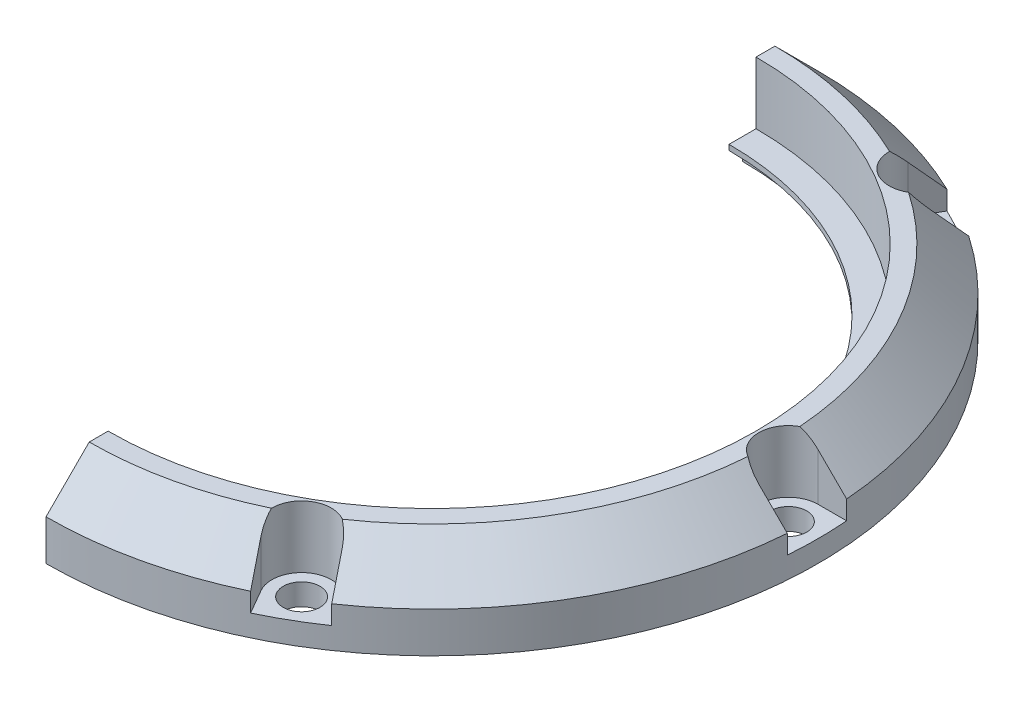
ISO-10303-21;
HEADER;
FILE_DESCRIPTION(('STEP AP214'),'2;1');
FILE_NAME('part.step','',(''),(''),'','','');
FILE_SCHEMA(('AUTOMOTIVE_DESIGN { 1 0 10303 214 1 1 1 1 }'));
ENDSEC;
DATA;
#1=APPLICATION_CONTEXT('core data for automotive mechanical design processes');
#2=APPLICATION_PROTOCOL_DEFINITION('international standard','automotive_design',2000,#1);
#3=PRODUCT_CONTEXT('',#1,'mechanical');
#4=PRODUCT('Part','Part','',(#3));
#5=PRODUCT_RELATED_PRODUCT_CATEGORY('part','',(#4));
#6=PRODUCT_DEFINITION_FORMATION('','',#4);
#7=PRODUCT_DEFINITION_CONTEXT('part definition',#1,'design');
#8=PRODUCT_DEFINITION('design','',#6,#7);
#9=PRODUCT_DEFINITION_SHAPE('','',#8);
#10=(LENGTH_UNIT() NAMED_UNIT(*) SI_UNIT(.MILLI.,.METRE.));
#11=(NAMED_UNIT(*) PLANE_ANGLE_UNIT() SI_UNIT($,.RADIAN.));
#12=(NAMED_UNIT(*) SI_UNIT($,.STERADIAN.) SOLID_ANGLE_UNIT());
#13=UNCERTAINTY_MEASURE_WITH_UNIT(LENGTH_MEASURE(1.E-05),#10,'distance_accuracy_value','');
#14=(GEOMETRIC_REPRESENTATION_CONTEXT(3) GLOBAL_UNCERTAINTY_ASSIGNED_CONTEXT((#13)) GLOBAL_UNIT_ASSIGNED_CONTEXT((#10,
#11,#12)) REPRESENTATION_CONTEXT('',''));
#15=CARTESIAN_POINT('',(0.,0.,0.));
#16=DIRECTION('',(0.,0.,1.));
#17=DIRECTION('',(1.,0.,0.));
#18=AXIS2_PLACEMENT_3D('',#15,#16,#17);
#19=CARTESIAN_POINT('',(0.,-10.51,-144.));
#20=DIRECTION('',(-1.,0.,0.));
#21=DIRECTION('',(0.,0.,1.));
#22=AXIS2_PLACEMENT_3D('',#19,#20,#21);
#23=PLANE('',#22);
#24=DIRECTION('',(0.,0.707106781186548,-0.707106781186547));
#25=VECTOR('',#24,1.);
#26=CARTESIAN_POINT('',(0.,68.5,-72.5));
#27=LINE('',#26,#25);
#28=CARTESIAN_POINT('',(0.,5.,-9.));
#29=VERTEX_POINT('',#28);
#30=CARTESIAN_POINT('',(0.,-3.,-1.));
#31=VERTEX_POINT('',#30);
#32=EDGE_CURVE('E305',#29,#31,#27,.F.);
#33=ORIENTED_EDGE('',*,*,#32,.F.);
#34=DIRECTION('',(0.,0.,1.));
#35=VECTOR('',#34,1.);
#36=CARTESIAN_POINT('',(0.,5.,-9.));
#37=LINE('',#36,#35);
#38=CARTESIAN_POINT('',(0.,5.,-12.5));
#39=VERTEX_POINT('',#38);
#40=EDGE_CURVE('E241',#39,#29,#37,.T.);
#41=ORIENTED_EDGE('',*,*,#40,.F.);
#42=DIRECTION('',(0.,-1.,0.));
#43=VECTOR('',#42,1.);
#44=CARTESIAN_POINT('',(0.,-10.5,-12.5));
#45=LINE('',#44,#43);
#46=CARTESIAN_POINT('',(0.,-6.5,-12.5));
#47=VERTEX_POINT('',#46);
#48=EDGE_CURVE('E294',#47,#39,#45,.F.);
#49=ORIENTED_EDGE('',*,*,#48,.F.);
#50=DIRECTION('',(0.,0.,1.));
#51=VECTOR('',#50,1.);
#52=CARTESIAN_POINT('',(0.,-6.5,-12.5));
#53=LINE('',#52,#51);
#54=CARTESIAN_POINT('',(0.,-6.5,-17.5));
#55=VERTEX_POINT('',#54);
#56=EDGE_CURVE('E299',#55,#47,#53,.T.);
#57=ORIENTED_EDGE('',*,*,#56,.F.);
#58=DIRECTION('',(0.,-1.,0.));
#59=VECTOR('',#58,1.);
#60=CARTESIAN_POINT('',(0.,-10.5,-17.5));
#61=LINE('',#60,#59);
#62=CARTESIAN_POINT('',(0.,-7.5,-17.5));
#63=VERTEX_POINT('',#62);
#64=EDGE_CURVE('E311',#63,#55,#61,.F.);
#65=ORIENTED_EDGE('',*,*,#64,.F.);
#66=DIRECTION('',(0.,0.,-1.));
#67=VECTOR('',#66,1.);
#68=CARTESIAN_POINT('',(0.,-7.5,-72.5));
#69=LINE('',#68,#67);
#70=CARTESIAN_POINT('',(0.,-7.5,-15.));
#71=VERTEX_POINT('',#70);
#72=EDGE_CURVE('E245',#71,#63,#69,.T.);
#73=ORIENTED_EDGE('',*,*,#72,.F.);
#74=DIRECTION('',(0.,-1.,0.));
#75=VECTOR('',#74,1.);
#76=CARTESIAN_POINT('',(0.,-7.5,-15.));
#77=LINE('',#76,#75);
#78=CARTESIAN_POINT('',(0.,-10.5,-15.));
#79=VERTEX_POINT('',#78);
#80=EDGE_CURVE('E227',#71,#79,#77,.T.);
#81=ORIENTED_EDGE('',*,*,#80,.T.);
#82=DIRECTION('',(0.,0.,-1.));
#83=VECTOR('',#82,1.);
#84=CARTESIAN_POINT('',(0.,-10.5,-1000.));
#85=LINE('',#84,#83);
#86=CARTESIAN_POINT('',(0.,-10.5,-1.));
#87=VERTEX_POINT('',#86);
#88=EDGE_CURVE('E234',#87,#79,#85,.T.);
#89=ORIENTED_EDGE('',*,*,#88,.F.);
#90=DIRECTION('',(0.,-1.,0.));
#91=VECTOR('',#90,1.);
#92=CARTESIAN_POINT('',(0.,-10.5,-1.00000000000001));
#93=LINE('',#92,#91);
#94=EDGE_CURVE('E302',#31,#87,#93,.T.);
#95=ORIENTED_EDGE('',*,*,#94,.F.);
#96=EDGE_LOOP('',(#33,#41,#49,#57,#65,#73,#81,#89,#95));
#97=FACE_BOUND('',#96,.T.);
#98=ADVANCED_FACE('F16',(#97),#23,.T.);
#99=DIRECTION('',(0.,-0.707106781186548,-0.707106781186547));
#100=VECTOR('',#99,1.);
#101=CARTESIAN_POINT('',(0.,68.5,-72.5));
#102=LINE('',#101,#100);
#103=CARTESIAN_POINT('',(0.,-3.,-144.));
#104=VERTEX_POINT('',#103);
#105=CARTESIAN_POINT('',(0.,5.,-136.));
#106=VERTEX_POINT('',#105);
#107=EDGE_CURVE('E308',#104,#106,#102,.F.);
#108=ORIENTED_EDGE('',*,*,#107,.F.);
#109=DIRECTION('',(0.,-1.,0.));
#110=VECTOR('',#109,1.);
#111=CARTESIAN_POINT('',(0.,-10.5,-144.));
#112=LINE('',#111,#110);
#113=CARTESIAN_POINT('',(0.,-10.5,-144.));
#114=VERTEX_POINT('',#113);
#115=EDGE_CURVE('E289',#114,#104,#112,.F.);
#116=ORIENTED_EDGE('',*,*,#115,.F.);
#117=CARTESIAN_POINT('',(0.,-10.5,-130.));
#118=VERTEX_POINT('',#117);
#119=EDGE_CURVE('E240',#118,#114,#85,.T.);
#120=ORIENTED_EDGE('',*,*,#119,.F.);
#121=DIRECTION('',(0.,-1.,0.));
#122=VECTOR('',#121,1.);
#123=CARTESIAN_POINT('',(0.,-7.5,-130.));
#124=LINE('',#123,#122);
#125=CARTESIAN_POINT('',(0.,-7.5,-130.));
#126=VERTEX_POINT('',#125);
#127=EDGE_CURVE('E230',#118,#126,#124,.F.);
#128=ORIENTED_EDGE('',*,*,#127,.T.);
#129=CARTESIAN_POINT('',(0.,-7.5,-127.5));
#130=VERTEX_POINT('',#129);
#131=EDGE_CURVE('E281',#130,#126,#69,.T.);
#132=ORIENTED_EDGE('',*,*,#131,.F.);
#133=DIRECTION('',(0.,-1.,0.));
#134=VECTOR('',#133,1.);
#135=CARTESIAN_POINT('',(0.,-10.5,-127.5));
#136=LINE('',#135,#134);
#137=CARTESIAN_POINT('',(0.,-6.5,-127.5));
#138=VERTEX_POINT('',#137);
#139=EDGE_CURVE('E247',#138,#130,#136,.T.);
#140=ORIENTED_EDGE('',*,*,#139,.F.);
#141=CARTESIAN_POINT('',(0.,-6.5,-132.5));
#142=VERTEX_POINT('',#141);
#143=EDGE_CURVE('E300',#142,#138,#53,.T.);
#144=ORIENTED_EDGE('',*,*,#143,.F.);
#145=DIRECTION('',(0.,-1.,0.));
#146=VECTOR('',#145,1.);
#147=CARTESIAN_POINT('',(0.,-10.5,-132.5));
#148=LINE('',#147,#146);
#149=CARTESIAN_POINT('',(0.,5.,-132.5));
#150=VERTEX_POINT('',#149);
#151=EDGE_CURVE('E297',#150,#142,#148,.T.);
#152=ORIENTED_EDGE('',*,*,#151,.F.);
#153=EDGE_CURVE('E293',#106,#150,#37,.T.);
#154=ORIENTED_EDGE('',*,*,#153,.F.);
#155=EDGE_LOOP('',(#108,#116,#120,#128,#132,#140,#144,#152,#154));
#156=FACE_BOUND('',#155,.T.);
#157=ADVANCED_FACE('F287',(#156),#23,.T.);
#158=CARTESIAN_POINT('',(28.2368602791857,5.,-12.5923233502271));
#159=DIRECTION('',(0.866025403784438,0.,-0.5));
#160=DIRECTION('',(-0.5,0.,-0.866025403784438));
#161=AXIS2_PLACEMENT_3D('',#158,#159,#160);
#162=PLANE('',#161);
#163=DIRECTION('',(0.,-1.,0.));
#164=VECTOR('',#163,1.);
#165=CARTESIAN_POINT('',(30.8809341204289,-10.5,-8.01265311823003));
#166=LINE('',#165,#164);
#167=CARTESIAN_POINT('',(30.8809341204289,-6.5,-8.01265311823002));
#168=VERTEX_POINT('',#167);
#169=CARTESIAN_POINT('',(30.8809341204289,-3.,-8.01265311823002));
#170=VERTEX_POINT('',#169);
#171=EDGE_CURVE('E366',#168,#170,#166,.F.);
#172=ORIENTED_EDGE('',*,*,#171,.F.);
#173=DIRECTION('',(0.5,0.,0.866025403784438));
#174=VECTOR('',#173,1.);
#175=CARTESIAN_POINT('',(28.2368602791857,-6.5,-12.5923233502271));
#176=LINE('',#175,#174);
#177=CARTESIAN_POINT('',(28.2368602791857,-6.5,-12.5923233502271));
#178=VERTEX_POINT('',#177);
#179=EDGE_CURVE('E506',#178,#168,#176,.T.);
#180=ORIENTED_EDGE('',*,*,#179,.F.);
#181=DIRECTION('',(0.,-1.,0.));
#182=VECTOR('',#181,1.);
#183=CARTESIAN_POINT('',(28.2368602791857,5.,-12.5923233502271));
#184=LINE('',#183,#182);
#185=CARTESIAN_POINT('',(28.2368602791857,2.27122981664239,-12.5923233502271));
#186=VERTEX_POINT('',#185);
#187=EDGE_CURVE('E372',#186,#178,#184,.T.);
#188=ORIENTED_EDGE('',*,*,#187,.F.);
#189=CARTESIAN_POINT('',(30.8810344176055,-3.0002,-8.01247939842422));
#190=CARTESIAN_POINT('',(30.4403735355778,-2.12148155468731,-8.77572643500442));
#191=CARTESIAN_POINT('',(29.999685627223,-1.24281733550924,-9.53902028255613));
#192=CARTESIAN_POINT('',(29.1182557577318,0.514402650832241,-11.0657015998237));
#193=CARTESIAN_POINT('',(28.6775137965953,1.39295841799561,-11.8290890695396));
#194=CARTESIAN_POINT('',(28.2367448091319,2.27145995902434,-12.5925233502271));
#195=B_SPLINE_CURVE_WITH_KNOTS('',3,(#189,#190,#191,#192,#193,#194),.UNSPECIFIED.,.F.,.F.,(4,2,
4),(0.,3.73361316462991,7.46722633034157),.UNSPECIFIED.);
#196=EDGE_CURVE('E373',#170,#186,#195,.T.);
#197=ORIENTED_EDGE('',*,*,#196,.F.);
#198=EDGE_LOOP('',(#172,#180,#188,#197));
#199=FACE_BOUND('',#198,.T.);
#200=ADVANCED_FACE('F399',(#199),#162,.T.);
#201=CARTESIAN_POINT('',(33.,-6.5,-15.3423233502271));
#202=DIRECTION('',(0.,1.,0.));
#203=DIRECTION('',(0.,0.,1.));
#204=AXIS2_PLACEMENT_3D('',#201,#202,#203);
#205=PLANE('',#204);
#206=CARTESIAN_POINT('',(33.,-6.5,-15.3423233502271));
#207=DIRECTION('',(0.,1.,0.));
#208=DIRECTION('',(0.,0.,1.));
#209=AXIS2_PLACEMENT_3D('',#206,#207,#208);
#210=CIRCLE('',#209,3.4);
#211=CARTESIAN_POINT('',(33.,-6.5,-11.9423233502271));
#212=VERTEX_POINT('',#211);
#213=EDGE_CURVE('E465',#212,#212,#210,.T.);
#214=ORIENTED_EDGE('',*,*,#213,.F.);
#215=EDGE_LOOP('',(#214));
#216=FACE_BOUND('',#215,.T.);
#217=CARTESIAN_POINT('',(33.,-6.5,-15.3423233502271));
#218=DIRECTION('',(0.,1.,0.));
#219=DIRECTION('',(0.,0.,1.));
#220=AXIS2_PLACEMENT_3D('',#217,#218,#219);
#221=CIRCLE('',#220,5.5);
#222=CARTESIAN_POINT('',(37.7631397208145,-6.5,-18.0923233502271));
#223=VERTEX_POINT('',#222);
#224=EDGE_CURVE('E513',#223,#178,#221,.T.);
#225=ORIENTED_EDGE('',*,*,#224,.T.);
#226=ORIENTED_EDGE('',*,*,#179,.T.);
#227=CARTESIAN_POINT('',(0.,-6.5,-72.5));
#228=DIRECTION('',(0.,1.,0.));
#229=DIRECTION('',(0.,0.,1.));
#230=AXIS2_PLACEMENT_3D('',#227,#228,#229);
#231=CIRCLE('',#230,71.5);
#232=CARTESIAN_POINT('',(40.4072135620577,-6.5,-13.51265311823));
#233=VERTEX_POINT('',#232);
#234=EDGE_CURVE('E510',#168,#233,#231,.T.);
#235=ORIENTED_EDGE('',*,*,#234,.T.);
#236=DIRECTION('',(-0.5,0.,-0.866025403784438));
#237=VECTOR('',#236,1.);
#238=CARTESIAN_POINT('',(37.7631397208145,-6.5,-18.0923233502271));
#239=LINE('',#238,#237);
#240=EDGE_CURVE('E364',#233,#223,#239,.T.);
#241=ORIENTED_EDGE('',*,*,#240,.T.);
#242=EDGE_LOOP('',(#225,#226,#235,#241));
#243=FACE_BOUND('',#242,.T.);
#244=ADVANCED_FACE('F398',(#216,#243),#205,.T.);
#245=CARTESIAN_POINT('',(37.7631397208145,5.,-18.0923233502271));
#246=DIRECTION('',(-0.866025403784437,0.,0.5));
#247=DIRECTION('',(0.5,0.,0.866025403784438));
#248=AXIS2_PLACEMENT_3D('',#245,#246,#247);
#249=PLANE('',#248);
#250=DIRECTION('',(0.,-1.,0.));
#251=VECTOR('',#250,1.);
#252=CARTESIAN_POINT('',(37.7631397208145,5.,-18.0923233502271));
#253=LINE('',#252,#251);
#254=CARTESIAN_POINT('',(37.7631397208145,2.27122981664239,-18.0923233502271));
#255=VERTEX_POINT('',#254);
#256=EDGE_CURVE('E375',#255,#223,#253,.T.);
#257=ORIENTED_EDGE('',*,*,#256,.T.);
#258=ORIENTED_EDGE('',*,*,#240,.F.);
#259=DIRECTION('',(0.,-1.,0.));
#260=VECTOR('',#259,1.);
#261=CARTESIAN_POINT('',(40.4072135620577,-10.5,-13.51265311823));
#262=LINE('',#261,#260);
#263=CARTESIAN_POINT('',(40.4072135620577,-3.,-13.51265311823));
#264=VERTEX_POINT('',#263);
#265=EDGE_CURVE('E353',#264,#233,#262,.T.);
#266=ORIENTED_EDGE('',*,*,#265,.F.);
#267=CARTESIAN_POINT('',(37.7630242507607,2.27145995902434,-18.0925233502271));
#268=CARTESIAN_POINT('',(38.2037932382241,1.39295841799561,-17.3290890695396));
#269=CARTESIAN_POINT('',(38.6445351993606,0.514402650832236,-16.5657015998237));
#270=CARTESIAN_POINT('',(39.5259650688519,-1.24281733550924,-15.0390202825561));
#271=CARTESIAN_POINT('',(39.9666529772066,-2.12148155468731,-14.2757264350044));
#272=CARTESIAN_POINT('',(40.4073138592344,-3.0002,-13.5124793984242));
#273=B_SPLINE_CURVE_WITH_KNOTS('',3,(#267,#268,#269,#270,#271,#272),.UNSPECIFIED.,.F.,.F.,(4,2,
4),(0.,3.73361316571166,7.46722633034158),.UNSPECIFIED.);
#274=EDGE_CURVE('E361',#255,#264,#273,.T.);
#275=ORIENTED_EDGE('',*,*,#274,.F.);
#276=EDGE_LOOP('',(#257,#258,#266,#275));
#277=FACE_BOUND('',#276,.T.);
#278=ADVANCED_FACE('F360',(#277),#249,.T.);
#279=CARTESIAN_POINT('',(66.,5.,-67.));
#280=DIRECTION('',(0.,0.,-1.));
#281=DIRECTION('',(-1.,0.,0.));
#282=AXIS2_PLACEMENT_3D('',#279,#280,#281);
#283=PLANE('',#282);
#284=DIRECTION('',(0.,-1.,0.));
#285=VECTOR('',#284,1.);
#286=CARTESIAN_POINT('',(71.2881476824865,-10.5,-67.));
#287=LINE('',#286,#285);
#288=CARTESIAN_POINT('',(71.2881476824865,-6.5,-67.));
#289=VERTEX_POINT('',#288);
#290=CARTESIAN_POINT('',(71.2881476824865,-3.,-67.));
#291=VERTEX_POINT('',#290);
#292=EDGE_CURVE('E52',#289,#291,#287,.F.);
#293=ORIENTED_EDGE('',*,*,#292,.F.);
#294=DIRECTION('',(1.,0.,0.));
#295=VECTOR('',#294,1.);
#296=CARTESIAN_POINT('',(66.,-6.5,-67.));
#297=LINE('',#296,#295);
#298=CARTESIAN_POINT('',(66.,-6.5,-67.));
#299=VERTEX_POINT('',#298);
#300=EDGE_CURVE('E550',#299,#289,#297,.T.);
#301=ORIENTED_EDGE('',*,*,#300,.F.);
#302=DIRECTION('',(0.,-1.,0.));
#303=VECTOR('',#302,1.);
#304=CARTESIAN_POINT('',(66.,5.,-67.));
#305=LINE('',#304,#303);
#306=CARTESIAN_POINT('',(66.,2.27122981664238,-67.));
#307=VERTEX_POINT('',#306);
#308=EDGE_CURVE('E60',#307,#299,#305,.T.);
#309=ORIENTED_EDGE('',*,*,#308,.F.);
#310=CARTESIAN_POINT('',(80.8781602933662,-12.5649542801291,-67.));
#311=CARTESIAN_POINT('',(78.8401535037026,-10.5316539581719,-67.));
#312=CARTESIAN_POINT('',(76.8019801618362,-8.4985205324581,-67.));
#313=CARTESIAN_POINT('',(72.7251831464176,-4.43270559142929,-67.));
#314=CARTESIAN_POINT('',(70.6865594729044,-2.40002407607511,-67.));
#315=CARTESIAN_POINT('',(66.6087441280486,1.66476936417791,-67.));
#316=CARTESIAN_POINT('',(64.5695524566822,3.69688128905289,-67.));
#317=CARTESIAN_POINT('',(60.4903984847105,7.76033186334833,-67.));
#318=CARTESIAN_POINT('',(58.4504361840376,9.79167051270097,-67.));
#319=CARTESIAN_POINT('',(56.4099873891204,11.8225205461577,-67.));
#320=B_SPLINE_CURVE_WITH_KNOTS('',3,(#310,#311,#312,#313,#314,#315,#316,#317,#318,#319),
.UNSPECIFIED.,.F.,.F.,(4,2,2,2,4),(0.,8.63655240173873,17.2731040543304,25.9096560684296,
34.5462088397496),.UNSPECIFIED.);
#321=EDGE_CURVE('E458',#291,#307,#320,.T.);
#322=ORIENTED_EDGE('',*,*,#321,.F.);
#323=EDGE_LOOP('',(#293,#301,#309,#322));
#324=FACE_BOUND('',#323,.T.);
#325=ADVANCED_FACE('F397',(#324),#283,.T.);
#326=CARTESIAN_POINT('',(66.,-6.5,-72.5));
#327=DIRECTION('',(0.,1.,0.));
#328=DIRECTION('',(0.86602540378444,0.,0.5));
#329=AXIS2_PLACEMENT_3D('',#326,#327,#328);
#330=PLANE('',#329);
#331=CARTESIAN_POINT('',(66.,-6.5,-72.5));
#332=DIRECTION('',(0.,1.,0.));
#333=DIRECTION('',(0.86602540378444,0.,0.5));
#334=AXIS2_PLACEMENT_3D('',#331,#332,#333);
#335=CIRCLE('',#334,3.4);
#336=CARTESIAN_POINT('',(68.9444863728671,-6.5,-70.8));
#337=VERTEX_POINT('',#336);
#338=EDGE_CURVE('E536',#337,#337,#335,.T.);
#339=ORIENTED_EDGE('',*,*,#338,.F.);
#340=EDGE_LOOP('',(#339));
#341=FACE_BOUND('',#340,.T.);
#342=CARTESIAN_POINT('',(66.,-6.5,-72.5));
#343=DIRECTION('',(0.,1.,0.));
#344=DIRECTION('',(0.86602540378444,0.,0.5));
#345=AXIS2_PLACEMENT_3D('',#342,#343,#344);
#346=CIRCLE('',#345,5.5);
#347=CARTESIAN_POINT('',(66.,-6.5,-78.));
#348=VERTEX_POINT('',#347);
#349=EDGE_CURVE('E547',#348,#299,#346,.T.);
#350=ORIENTED_EDGE('',*,*,#349,.T.);
#351=ORIENTED_EDGE('',*,*,#300,.T.);
#352=CARTESIAN_POINT('',(0.,-6.5,-72.5));
#353=DIRECTION('',(0.,1.,0.));
#354=DIRECTION('',(0.86602540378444,0.,0.5));
#355=AXIS2_PLACEMENT_3D('',#352,#353,#354);
#356=CIRCLE('',#355,71.5);
#357=CARTESIAN_POINT('',(71.2881476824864,-6.5,-78.));
#358=VERTEX_POINT('',#357);
#359=EDGE_CURVE('E552',#289,#358,#356,.T.);
#360=ORIENTED_EDGE('',*,*,#359,.T.);
#361=DIRECTION('',(-1.,0.,0.));
#362=VECTOR('',#361,1.);
#363=CARTESIAN_POINT('',(66.,-6.5,-78.));
#364=LINE('',#363,#362);
#365=EDGE_CURVE('E554',#358,#348,#364,.T.);
#366=ORIENTED_EDGE('',*,*,#365,.T.);
#367=EDGE_LOOP('',(#350,#351,#360,#366));
#368=FACE_BOUND('',#367,.T.);
#369=ADVANCED_FACE('F453',(#341,#368),#330,.T.);
#370=CARTESIAN_POINT('',(66.,5.,-78.));
#371=DIRECTION('',(0.,0.,1.));
#372=DIRECTION('',(1.,0.,0.));
#373=AXIS2_PLACEMENT_3D('',#370,#371,#372);
#374=PLANE('',#373);
#375=DIRECTION('',(0.,-1.,0.));
#376=VECTOR('',#375,1.);
#377=CARTESIAN_POINT('',(66.,5.,-78.));
#378=LINE('',#377,#376);
#379=CARTESIAN_POINT('',(66.,2.27122981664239,-78.));
#380=VERTEX_POINT('',#379);
#381=EDGE_CURVE('E557',#380,#348,#378,.T.);
#382=ORIENTED_EDGE('',*,*,#381,.T.);
#383=ORIENTED_EDGE('',*,*,#365,.F.);
#384=DIRECTION('',(0.,-1.,0.));
#385=VECTOR('',#384,1.);
#386=CARTESIAN_POINT('',(71.2881476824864,-10.5,-78.));
#387=LINE('',#386,#385);
#388=CARTESIAN_POINT('',(71.2881476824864,-3.,-78.));
#389=VERTEX_POINT('',#388);
#390=EDGE_CURVE('E671',#389,#358,#387,.T.);
#391=ORIENTED_EDGE('',*,*,#390,.F.);
#392=CARTESIAN_POINT('',(56.4099873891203,11.8225205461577,-78.));
#393=CARTESIAN_POINT('',(58.4504361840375,9.79167051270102,-78.));
#394=CARTESIAN_POINT('',(60.4903984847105,7.76033186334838,-78.));
#395=CARTESIAN_POINT('',(64.5695524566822,3.69688128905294,-78.));
#396=CARTESIAN_POINT('',(66.6087441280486,1.66476936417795,-78.));
#397=CARTESIAN_POINT('',(70.6865594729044,-2.40002407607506,-78.));
#398=CARTESIAN_POINT('',(72.7251831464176,-4.43270559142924,-78.));
#399=CARTESIAN_POINT('',(76.8019801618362,-8.49852053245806,-78.));
#400=CARTESIAN_POINT('',(78.8401535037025,-10.5316539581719,-78.));
#401=CARTESIAN_POINT('',(80.8781602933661,-12.5649542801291,-78.));
#402=B_SPLINE_CURVE_WITH_KNOTS('',3,(#392,#393,#394,#395,#396,#397,#398,#399,#400,#401),
.UNSPECIFIED.,.F.,.F.,(4,2,2,2,4),(0.,8.6365527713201,17.2731047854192,25.9096564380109,
34.5462088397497),.UNSPECIFIED.);
#403=EDGE_CURVE('E464',#380,#389,#402,.T.);
#404=ORIENTED_EDGE('',*,*,#403,.F.);
#405=EDGE_LOOP('',(#382,#383,#391,#404));
#406=FACE_BOUND('',#405,.T.);
#407=ADVANCED_FACE('F454',(#406),#374,.T.);
#408=CARTESIAN_POINT('',(37.7631397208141,5.,-126.907676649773));
#409=DIRECTION('',(-0.866025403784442,0.,-0.5));
#410=DIRECTION('',(-0.5,0.,0.866025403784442));
#411=AXIS2_PLACEMENT_3D('',#408,#409,#410);
#412=PLANE('',#411);
#413=DIRECTION('',(0.,-1.,0.));
#414=VECTOR('',#413,1.);
#415=CARTESIAN_POINT('',(40.4072135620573,-10.5,-131.48734688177));
#416=LINE('',#415,#414);
#417=CARTESIAN_POINT('',(40.4072135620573,-6.5,-131.48734688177));
#418=VERTEX_POINT('',#417);
#419=CARTESIAN_POINT('',(40.4072135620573,-3.,-131.48734688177));
#420=VERTEX_POINT('',#419);
#421=EDGE_CURVE('E670',#418,#420,#416,.F.);
#422=ORIENTED_EDGE('',*,*,#421,.F.);
#423=DIRECTION('',(0.5,0.,-0.866025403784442));
#424=VECTOR('',#423,1.);
#425=CARTESIAN_POINT('',(37.7631397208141,-6.5,-126.907676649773));
#426=LINE('',#425,#424);
#427=CARTESIAN_POINT('',(37.7631397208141,-6.5,-126.907676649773));
#428=VERTEX_POINT('',#427);
#429=EDGE_CURVE('E541',#428,#418,#426,.T.);
#430=ORIENTED_EDGE('',*,*,#429,.F.);
#431=DIRECTION('',(0.,-1.,0.));
#432=VECTOR('',#431,1.);
#433=CARTESIAN_POINT('',(37.7631397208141,5.,-126.907676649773));
#434=LINE('',#433,#432);
#435=CARTESIAN_POINT('',(37.7631397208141,2.27122981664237,-126.907676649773));
#436=VERTEX_POINT('',#435);
#437=EDGE_CURVE('E33',#436,#428,#434,.T.);
#438=ORIENTED_EDGE('',*,*,#437,.F.);
#439=CARTESIAN_POINT('',(40.4073138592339,-3.0002,-131.487520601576));
#440=CARTESIAN_POINT('',(39.9666529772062,-2.12148155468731,-130.724273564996));
#441=CARTESIAN_POINT('',(39.5259650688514,-1.24281733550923,-129.960979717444));
#442=CARTESIAN_POINT('',(38.6445351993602,0.514402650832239,-128.434298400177));
#443=CARTESIAN_POINT('',(38.2037932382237,1.3929584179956,-127.670910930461));
#444=CARTESIAN_POINT('',(37.7630242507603,2.27145995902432,-126.907476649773));
#445=B_SPLINE_CURVE_WITH_KNOTS('',3,(#439,#440,#441,#442,#443,#444),.UNSPECIFIED.,.F.,.F.,(4,2,
4),(0.,3.73361316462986,7.46722633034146),.UNSPECIFIED.);
#446=EDGE_CURVE('E473',#420,#436,#445,.T.);
#447=ORIENTED_EDGE('',*,*,#446,.F.);
#448=EDGE_LOOP('',(#422,#430,#438,#447));
#449=FACE_BOUND('',#448,.T.);
#450=ADVANCED_FACE('F415',(#449),#412,.T.);
#451=CARTESIAN_POINT('',(32.9999999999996,-6.5,-129.657676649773));
#452=DIRECTION('',(0.,1.,0.));
#453=DIRECTION('',(0.866025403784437,0.,-0.5));
#454=AXIS2_PLACEMENT_3D('',#451,#452,#453);
#455=PLANE('',#454);
#456=CARTESIAN_POINT('',(32.9999999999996,-6.5,-129.657676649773));
#457=DIRECTION('',(0.,1.,0.));
#458=DIRECTION('',(0.866025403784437,0.,-0.5));
#459=AXIS2_PLACEMENT_3D('',#456,#457,#458);
#460=CIRCLE('',#459,3.4);
#461=CARTESIAN_POINT('',(35.9444863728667,-6.5,-131.357676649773));
#462=VERTEX_POINT('',#461);
#463=EDGE_CURVE('E278',#462,#462,#460,.T.);
#464=ORIENTED_EDGE('',*,*,#463,.F.);
#465=EDGE_LOOP('',(#464));
#466=FACE_BOUND('',#465,.T.);
#467=CARTESIAN_POINT('',(32.9999999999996,-6.5,-129.657676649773));
#468=DIRECTION('',(0.,1.,0.));
#469=DIRECTION('',(0.866025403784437,0.,-0.5));
#470=AXIS2_PLACEMENT_3D('',#467,#468,#469);
#471=CIRCLE('',#470,5.5);
#472=CARTESIAN_POINT('',(28.2368602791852,-6.5,-132.407676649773));
#473=VERTEX_POINT('',#472);
#474=EDGE_CURVE('E537',#473,#428,#471,.T.);
#475=ORIENTED_EDGE('',*,*,#474,.T.);
#476=ORIENTED_EDGE('',*,*,#429,.T.);
#477=CARTESIAN_POINT('',(0.,-6.5,-72.5));
#478=DIRECTION('',(0.,1.,0.));
#479=DIRECTION('',(0.866025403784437,0.,-0.5));
#480=AXIS2_PLACEMENT_3D('',#477,#478,#479);
#481=CIRCLE('',#480,71.5);
#482=CARTESIAN_POINT('',(30.8809341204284,-6.5,-136.98734688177));
#483=VERTEX_POINT('',#482);
#484=EDGE_CURVE('E562',#418,#483,#481,.T.);
#485=ORIENTED_EDGE('',*,*,#484,.T.);
#486=DIRECTION('',(-0.499999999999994,0.,0.866025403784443));
#487=VECTOR('',#486,1.);
#488=CARTESIAN_POINT('',(28.2368602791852,-6.5,-132.407676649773));
#489=LINE('',#488,#487);
#490=EDGE_CURVE('E564',#483,#473,#489,.T.);
#491=ORIENTED_EDGE('',*,*,#490,.T.);
#492=EDGE_LOOP('',(#475,#476,#485,#491));
#493=FACE_BOUND('',#492,.T.);
#494=ADVANCED_FACE('F448',(#466,#493),#455,.T.);
#495=CARTESIAN_POINT('',(28.2368602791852,5.,-132.407676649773));
#496=DIRECTION('',(0.866025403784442,0.,0.499999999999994));
#497=DIRECTION('',(0.499999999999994,0.,-0.866025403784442));
#498=AXIS2_PLACEMENT_3D('',#495,#496,#497);
#499=PLANE('',#498);
#500=DIRECTION('',(0.,-1.,0.));
#501=VECTOR('',#500,1.);
#502=CARTESIAN_POINT('',(28.2368602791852,5.,-132.407676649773));
#503=LINE('',#502,#501);
#504=CARTESIAN_POINT('',(28.2368602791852,2.27122981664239,-132.407676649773));
#505=VERTEX_POINT('',#504);
#506=EDGE_CURVE('E67',#505,#473,#503,.T.);
#507=ORIENTED_EDGE('',*,*,#506,.T.);
#508=ORIENTED_EDGE('',*,*,#490,.F.);
#509=DIRECTION('',(0.,-1.,0.));
#510=VECTOR('',#509,1.);
#511=CARTESIAN_POINT('',(30.8809341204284,-10.5,-136.98734688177));
#512=LINE('',#511,#510);
#513=CARTESIAN_POINT('',(30.8809341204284,-3.,-136.98734688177));
#514=VERTEX_POINT('',#513);
#515=EDGE_CURVE('E578',#514,#483,#512,.T.);
#516=ORIENTED_EDGE('',*,*,#515,.F.);
#517=CARTESIAN_POINT('',(28.2367448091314,2.27145995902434,-132.407476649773));
#518=CARTESIAN_POINT('',(28.6775137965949,1.39295841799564,-133.17091093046));
#519=CARTESIAN_POINT('',(29.1182557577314,0.514402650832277,-133.934298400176));
#520=CARTESIAN_POINT('',(29.9996856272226,-1.2428173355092,-135.460979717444));
#521=CARTESIAN_POINT('',(30.4403735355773,-2.12148155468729,-136.224273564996));
#522=CARTESIAN_POINT('',(30.8810344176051,-3.0002,-136.987520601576));
#523=B_SPLINE_CURVE_WITH_KNOTS('',3,(#517,#518,#519,#520,#521,#522),.UNSPECIFIED.,.F.,.F.,(4,2,
4),(0.,3.73361316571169,7.46722633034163),.UNSPECIFIED.);
#524=EDGE_CURVE('E343',#505,#514,#523,.T.);
#525=ORIENTED_EDGE('',*,*,#524,.F.);
#526=EDGE_LOOP('',(#507,#508,#516,#525));
#527=FACE_BOUND('',#526,.T.);
#528=ADVANCED_FACE('F481',(#527),#499,.T.);
#529=CARTESIAN_POINT('',(59.4866916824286,-1.49999999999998,-80.3315715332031));
#530=DIRECTION('',(0.130526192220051,0.,0.99144486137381));
#531=DIRECTION('',(0.99144486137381,0.,-0.130526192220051));
#532=AXIS2_PLACEMENT_3D('',#529,#530,#531);
#533=PLANE('',#532);
#534=DIRECTION('',(-0.99144486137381,0.,0.130526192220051));
#535=VECTOR('',#534,1.);
#536=CARTESIAN_POINT('',(59.4866916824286,-1.49999999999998,-80.3315715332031));
#537=LINE('',#536,#535);
#538=CARTESIAN_POINT('',(57.980455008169,-1.49999999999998,-80.1332717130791));
#539=VERTEX_POINT('',#538);
#540=CARTESIAN_POINT('',(54.5294673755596,-1.49999999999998,-79.6789405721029));
#541=VERTEX_POINT('',#540);
#542=EDGE_CURVE('E651',#539,#541,#537,.T.);
#543=ORIENTED_EDGE('',*,*,#542,.F.);
#544=DIRECTION('',(0.,-1.,0.));
#545=VECTOR('',#544,1.);
#546=CARTESIAN_POINT('',(57.980455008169,-1.49999999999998,-80.1332717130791));
#547=LINE('',#546,#545);
#548=CARTESIAN_POINT('',(57.980455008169,-6.5,-80.1332717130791));
#549=VERTEX_POINT('',#548);
#550=EDGE_CURVE('E253',#539,#549,#547,.T.);
#551=ORIENTED_EDGE('',*,*,#550,.T.);
#552=DIRECTION('',(-0.99144486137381,0.,0.130526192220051));
#553=VECTOR('',#552,1.);
#554=CARTESIAN_POINT('',(59.4866916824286,-6.5,-80.3315715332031));
#555=LINE('',#554,#553);
#556=CARTESIAN_POINT('',(54.5294673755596,-6.5,-79.6789405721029));
#557=VERTEX_POINT('',#556);
#558=EDGE_CURVE('E378',#549,#557,#555,.T.);
#559=ORIENTED_EDGE('',*,*,#558,.T.);
#560=DIRECTION('',(0.,-1.,0.));
#561=VECTOR('',#560,1.);
#562=CARTESIAN_POINT('',(54.5294673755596,-1.49999999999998,-79.6789405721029));
#563=LINE('',#562,#561);
#564=EDGE_CURVE('E636',#541,#557,#563,.T.);
#565=ORIENTED_EDGE('',*,*,#564,.F.);
#566=EDGE_LOOP('',(#543,#551,#559,#565));
#567=FACE_BOUND('',#566,.T.);
#568=ADVANCED_FACE('F484',(#567),#533,.F.);
#569=CARTESIAN_POINT('',(59.4866916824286,-1.49999999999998,-64.6684284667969));
#570=DIRECTION('',(0.130526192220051,0.,-0.99144486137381));
#571=DIRECTION('',(-0.99144486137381,0.,-0.130526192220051));
#572=AXIS2_PLACEMENT_3D('',#569,#570,#571);
#573=PLANE('',#572);
#574=DIRECTION('',(0.99144486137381,0.,0.130526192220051));
#575=VECTOR('',#574,1.);
#576=CARTESIAN_POINT('',(59.4866916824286,-6.5,-64.6684284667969));
#577=LINE('',#576,#575);
#578=CARTESIAN_POINT('',(54.5294673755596,-6.5,-65.3210594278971));
#579=VERTEX_POINT('',#578);
#580=CARTESIAN_POINT('',(57.980455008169,-6.5,-64.8667282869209));
#581=VERTEX_POINT('',#580);
#582=EDGE_CURVE('E642',#579,#581,#577,.T.);
#583=ORIENTED_EDGE('',*,*,#582,.T.);
#584=DIRECTION('',(0.,-1.,0.));
#585=VECTOR('',#584,1.);
#586=CARTESIAN_POINT('',(57.980455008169,-1.49999999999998,-64.8667282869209));
#587=LINE('',#586,#585);
#588=CARTESIAN_POINT('',(57.980455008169,-1.49999999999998,-64.8667282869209));
#589=VERTEX_POINT('',#588);
#590=EDGE_CURVE('E620',#581,#589,#587,.F.);
#591=ORIENTED_EDGE('',*,*,#590,.T.);
#592=DIRECTION('',(0.99144486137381,0.,0.130526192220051));
#593=VECTOR('',#592,1.);
#594=CARTESIAN_POINT('',(59.4866916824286,-1.49999999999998,-64.6684284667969));
#595=LINE('',#594,#593);
#596=CARTESIAN_POINT('',(54.5294673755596,-1.49999999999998,-65.3210594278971));
#597=VERTEX_POINT('',#596);
#598=EDGE_CURVE('E641',#597,#589,#595,.T.);
#599=ORIENTED_EDGE('',*,*,#598,.F.);
#600=DIRECTION('',(0.,-1.,0.));
#601=VECTOR('',#600,1.);
#602=CARTESIAN_POINT('',(54.5294673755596,-1.49999999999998,-65.3210594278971));
#603=LINE('',#602,#601);
#604=EDGE_CURVE('E638',#597,#579,#603,.T.);
#605=ORIENTED_EDGE('',*,*,#604,.T.);
#606=EDGE_LOOP('',(#583,#591,#599,#605));
#607=FACE_BOUND('',#606,.T.);
#608=ADVANCED_FACE('F491',(#607),#573,.F.);
#609=CARTESIAN_POINT('',(0.,-10.5,-72.5));
#610=DIRECTION('',(0.,-1.,0.));
#611=DIRECTION('',(0.,0.,-1.));
#612=AXIS2_PLACEMENT_3D('',#609,#610,#611);
#613=CYLINDRICAL_SURFACE('',#612,71.5);
#614=CARTESIAN_POINT('',(0.,-10.5,-72.5));
#615=DIRECTION('',(0.,-1.,0.));
#616=DIRECTION('',(0.,0.,-1.));
#617=AXIS2_PLACEMENT_3D('',#614,#615,#616);
#618=CIRCLE('',#617,71.5);
#619=EDGE_CURVE('E237',#114,#87,#618,.T.);
#620=ORIENTED_EDGE('',*,*,#619,.F.);
#621=ORIENTED_EDGE('',*,*,#115,.T.);
#622=CARTESIAN_POINT('',(0.,-3.,-72.5));
#623=DIRECTION('',(0.,-1.,0.));
#624=DIRECTION('',(0.,0.,-1.));
#625=AXIS2_PLACEMENT_3D('',#622,#623,#624);
#626=CIRCLE('',#625,71.5);
#627=EDGE_CURVE('E256',#104,#514,#626,.T.);
#628=ORIENTED_EDGE('',*,*,#627,.T.);
#629=ORIENTED_EDGE('',*,*,#515,.T.);
#630=ORIENTED_EDGE('',*,*,#484,.F.);
#631=ORIENTED_EDGE('',*,*,#421,.T.);
#632=EDGE_CURVE('E257',#420,#389,#626,.T.);
#633=ORIENTED_EDGE('',*,*,#632,.T.);
#634=ORIENTED_EDGE('',*,*,#390,.T.);
#635=ORIENTED_EDGE('',*,*,#359,.F.);
#636=ORIENTED_EDGE('',*,*,#292,.T.);
#637=EDGE_CURVE('E262',#291,#264,#626,.T.);
#638=ORIENTED_EDGE('',*,*,#637,.T.);
#639=ORIENTED_EDGE('',*,*,#265,.T.);
#640=ORIENTED_EDGE('',*,*,#234,.F.);
#641=ORIENTED_EDGE('',*,*,#171,.T.);
#642=EDGE_CURVE('E252',#170,#31,#626,.T.);
#643=ORIENTED_EDGE('',*,*,#642,.T.);
#644=ORIENTED_EDGE('',*,*,#94,.T.);
#645=EDGE_LOOP('',(#620,#621,#628,#629,#630,#631,#633,#634,#635,#636,#638,#639,#640,#641,#643,#644));
#646=FACE_BOUND('',#645,.T.);
#647=ADVANCED_FACE('F351',(#646),#613,.T.);
#648=CARTESIAN_POINT('',(66.,-10.5,-72.5));
#649=DIRECTION('',(0.,1.,0.));
#650=DIRECTION('',(0.,0.,1.));
#651=AXIS2_PLACEMENT_3D('',#648,#649,#650);
#652=CYLINDRICAL_SURFACE('',#651,3.4);
#653=CARTESIAN_POINT('',(66.,-10.5,-72.5));
#654=DIRECTION('',(0.,1.,0.));
#655=DIRECTION('',(0.86602540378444,0.,0.5));
#656=AXIS2_PLACEMENT_3D('',#653,#654,#655);
#657=CIRCLE('',#656,3.4);
#658=CARTESIAN_POINT('',(68.9444863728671,-10.5,-70.8));
#659=VERTEX_POINT('',#658);
#660=EDGE_CURVE('E534',#659,#659,#657,.T.);
#661=ORIENTED_EDGE('',*,*,#660,.F.);
#662=EDGE_LOOP('',(#661));
#663=FACE_BOUND('',#662,.T.);
#664=ORIENTED_EDGE('',*,*,#338,.T.);
#665=EDGE_LOOP('',(#664));
#666=FACE_BOUND('',#665,.T.);
#667=ADVANCED_FACE('F690',(#663,#666),#652,.F.);
#668=CARTESIAN_POINT('',(32.9999999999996,-10.5,-129.657676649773));
#669=DIRECTION('',(0.,1.,0.));
#670=DIRECTION('',(0.,0.,1.));
#671=AXIS2_PLACEMENT_3D('',#668,#669,#670);
#672=CYLINDRICAL_SURFACE('',#671,3.4);
#673=CARTESIAN_POINT('',(32.9999999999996,-10.5,-129.657676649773));
#674=DIRECTION('',(0.,1.,0.));
#675=DIRECTION('',(0.866025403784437,0.,-0.5));
#676=AXIS2_PLACEMENT_3D('',#673,#674,#675);
#677=CIRCLE('',#676,3.4);
#678=CARTESIAN_POINT('',(35.9444863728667,-10.5,-131.357676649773));
#679=VERTEX_POINT('',#678);
#680=EDGE_CURVE('E531',#679,#679,#677,.T.);
#681=ORIENTED_EDGE('',*,*,#680,.F.);
#682=EDGE_LOOP('',(#681));
#683=FACE_BOUND('',#682,.T.);
#684=ORIENTED_EDGE('',*,*,#463,.T.);
#685=EDGE_LOOP('',(#684));
#686=FACE_BOUND('',#685,.T.);
#687=ADVANCED_FACE('F408',(#683,#686),#672,.F.);
#688=CARTESIAN_POINT('',(33.,-10.5,-15.3423233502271));
#689=DIRECTION('',(0.,1.,0.));
#690=DIRECTION('',(0.,0.,1.));
#691=AXIS2_PLACEMENT_3D('',#688,#689,#690);
#692=CYLINDRICAL_SURFACE('',#691,3.4);
#693=CARTESIAN_POINT('',(33.,-10.5,-15.3423233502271));
#694=DIRECTION('',(0.,1.,0.));
#695=DIRECTION('',(0.,0.,1.));
#696=AXIS2_PLACEMENT_3D('',#693,#694,#695);
#697=CIRCLE('',#696,3.4);
#698=CARTESIAN_POINT('',(33.,-10.5,-11.9423233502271));
#699=VERTEX_POINT('',#698);
#700=EDGE_CURVE('E466',#699,#699,#697,.T.);
#701=ORIENTED_EDGE('',*,*,#700,.F.);
#702=EDGE_LOOP('',(#701));
#703=FACE_BOUND('',#702,.T.);
#704=ORIENTED_EDGE('',*,*,#213,.T.);
#705=EDGE_LOOP('',(#704));
#706=FACE_BOUND('',#705,.T.);
#707=ADVANCED_FACE('F405',(#703,#706),#692,.F.);
#708=CARTESIAN_POINT('',(74.,-10.5,-1000.));
#709=DIRECTION('',(0.,-1.,0.));
#710=DIRECTION('',(1.,0.,0.));
#711=AXIS2_PLACEMENT_3D('',#708,#709,#710);
#712=PLANE('',#711);
#713=ORIENTED_EDGE('',*,*,#700,.T.);
#714=EDGE_LOOP('',(#713));
#715=FACE_BOUND('',#714,.T.);
#716=ORIENTED_EDGE('',*,*,#680,.T.);
#717=EDGE_LOOP('',(#716));
#718=FACE_BOUND('',#717,.T.);
#719=ORIENTED_EDGE('',*,*,#660,.T.);
#720=EDGE_LOOP('',(#719));
#721=FACE_BOUND('',#720,.T.);
#722=ORIENTED_EDGE('',*,*,#619,.T.);
#723=ORIENTED_EDGE('',*,*,#88,.T.);
#724=CARTESIAN_POINT('',(0.,-10.5,-72.5));
#725=DIRECTION('',(0.,-1.,0.));
#726=DIRECTION('',(1.,0.,0.));
#727=AXIS2_PLACEMENT_3D('',#724,#725,#726);
#728=CIRCLE('',#727,57.5);
#729=EDGE_CURVE('E10',#118,#79,#728,.T.);
#730=ORIENTED_EDGE('',*,*,#729,.F.);
#731=ORIENTED_EDGE('',*,*,#119,.T.);
#732=EDGE_LOOP('',(#722,#723,#730,#731));
#733=FACE_BOUND('',#732,.T.);
#734=ADVANCED_FACE('F235',(#715,#718,#721,#733),#712,.T.);
#735=CARTESIAN_POINT('',(0.,-10.5,-72.5));
#736=DIRECTION('',(0.,-1.,0.));
#737=DIRECTION('',(0.,0.,-1.));
#738=AXIS2_PLACEMENT_3D('',#735,#736,#737);
#739=CYLINDRICAL_SURFACE('',#738,55.);
#740=CARTESIAN_POINT('',(0.,-6.5,-72.5));
#741=DIRECTION('',(0.,-1.,0.));
#742=DIRECTION('',(0.,0.,-1.));
#743=AXIS2_PLACEMENT_3D('',#740,#741,#742);
#744=CIRCLE('',#743,55.);
#745=EDGE_CURVE('E275',#138,#557,#744,.T.);
#746=ORIENTED_EDGE('',*,*,#745,.F.);
#747=ORIENTED_EDGE('',*,*,#139,.T.);
#748=CARTESIAN_POINT('',(0.,-7.5,-72.5));
#749=DIRECTION('',(0.,-1.,0.));
#750=DIRECTION('',(1.,0.,0.));
#751=AXIS2_PLACEMENT_3D('',#748,#749,#750);
#752=CIRCLE('',#751,55.);
#753=EDGE_CURVE('E276',#130,#63,#752,.T.);
#754=ORIENTED_EDGE('',*,*,#753,.T.);
#755=ORIENTED_EDGE('',*,*,#64,.T.);
#756=EDGE_CURVE('E272',#579,#55,#744,.T.);
#757=ORIENTED_EDGE('',*,*,#756,.F.);
#758=ORIENTED_EDGE('',*,*,#604,.F.);
#759=CARTESIAN_POINT('',(0.,-1.49999999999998,-72.5));
#760=DIRECTION('',(0.,-1.,0.));
#761=DIRECTION('',(0.,0.,1.));
#762=AXIS2_PLACEMENT_3D('',#759,#760,#761);
#763=CIRCLE('',#762,55.);
#764=EDGE_CURVE('E649',#541,#597,#763,.T.);
#765=ORIENTED_EDGE('',*,*,#764,.F.);
#766=ORIENTED_EDGE('',*,*,#564,.T.);
#767=EDGE_LOOP('',(#746,#747,#754,#755,#757,#758,#765,#766));
#768=FACE_BOUND('',#767,.T.);
#769=ADVANCED_FACE('F315',(#768),#739,.F.);
#770=CARTESIAN_POINT('',(0.,-7.5,-72.5));
#771=DIRECTION('',(0.,-1.,0.));
#772=DIRECTION('',(1.,0.,0.));
#773=AXIS2_PLACEMENT_3D('',#770,#771,#772);
#774=CYLINDRICAL_SURFACE('',#773,57.5);
#775=ORIENTED_EDGE('',*,*,#127,.F.);
#776=ORIENTED_EDGE('',*,*,#729,.T.);
#777=ORIENTED_EDGE('',*,*,#80,.F.);
#778=CARTESIAN_POINT('',(0.,-7.5,-72.5));
#779=DIRECTION('',(0.,-1.,0.));
#780=DIRECTION('',(1.,0.,0.));
#781=AXIS2_PLACEMENT_3D('',#778,#779,#780);
#782=CIRCLE('',#781,57.5);
#783=EDGE_CURVE('E25',#126,#71,#782,.T.);
#784=ORIENTED_EDGE('',*,*,#783,.F.);
#785=EDGE_LOOP('',(#775,#776,#777,#784));
#786=FACE_BOUND('',#785,.T.);
#787=ADVANCED_FACE('F224',(#786),#774,.F.);
#788=CARTESIAN_POINT('',(0.,-7.5,-72.5));
#789=DIRECTION('',(0.,-1.,0.));
#790=DIRECTION('',(1.,0.,0.));
#791=AXIS2_PLACEMENT_3D('',#788,#789,#790);
#792=PLANE('',#791);
#793=ORIENTED_EDGE('',*,*,#783,.T.);
#794=ORIENTED_EDGE('',*,*,#72,.T.);
#795=ORIENTED_EDGE('',*,*,#753,.F.);
#796=ORIENTED_EDGE('',*,*,#131,.T.);
#797=EDGE_LOOP('',(#793,#794,#795,#796));
#798=FACE_BOUND('',#797,.T.);
#799=ADVANCED_FACE('F18',(#798),#792,.T.);
#800=CARTESIAN_POINT('',(0.,-6.5,-12.5));
#801=DIRECTION('',(0.,1.,0.));
#802=DIRECTION('',(0.,0.,1.));
#803=AXIS2_PLACEMENT_3D('',#800,#801,#802);
#804=PLANE('',#803);
#805=ORIENTED_EDGE('',*,*,#756,.T.);
#806=ORIENTED_EDGE('',*,*,#56,.T.);
#807=CARTESIAN_POINT('',(0.,-6.5,-72.5));
#808=DIRECTION('',(0.,-1.,0.));
#809=DIRECTION('',(0.,0.,-1.));
#810=AXIS2_PLACEMENT_3D('',#807,#808,#809);
#811=CIRCLE('',#810,60.);
#812=CARTESIAN_POINT('',(59.2663238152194,-6.5,-63.145703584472));
#813=VERTEX_POINT('',#812);
#814=EDGE_CURVE('E267',#813,#47,#811,.T.);
#815=ORIENTED_EDGE('',*,*,#814,.F.);
#816=CARTESIAN_POINT('',(57.7846657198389,-6.5,-63.3795609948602));
#817=DIRECTION('',(0.,1.,0.));
#818=DIRECTION('',(0.,0.,1.));
#819=AXIS2_PLACEMENT_3D('',#816,#817,#818);
#820=CIRCLE('',#819,1.5);
#821=EDGE_CURVE('E632',#813,#581,#820,.T.);
#822=ORIENTED_EDGE('',*,*,#821,.T.);
#823=ORIENTED_EDGE('',*,*,#582,.F.);
#824=EDGE_LOOP('',(#805,#806,#815,#822,#823));
#825=FACE_BOUND('',#824,.T.);
#826=ADVANCED_FACE('F608',(#825),#804,.T.);
#827=CARTESIAN_POINT('',(57.7846657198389,-10.5,-63.3795609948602));
#828=DIRECTION('',(0.,-1.,0.));
#829=DIRECTION('',(0.,0.,-1.));
#830=AXIS2_PLACEMENT_3D('',#827,#828,#829);
#831=CYLINDRICAL_SURFACE('',#830,1.5);
#832=CARTESIAN_POINT('',(57.7846657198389,-1.49999999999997,-63.3795609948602));
#833=DIRECTION('',(0.,1.,0.));
#834=DIRECTION('',(0.,0.,1.));
#835=AXIS2_PLACEMENT_3D('',#832,#833,#834);
#836=CIRCLE('',#835,1.5);
#837=CARTESIAN_POINT('',(59.2663238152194,-1.49999999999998,-63.145703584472));
#838=VERTEX_POINT('',#837);
#839=EDGE_CURVE('E365',#589,#838,#836,.F.);
#840=ORIENTED_EDGE('',*,*,#839,.F.);
#841=ORIENTED_EDGE('',*,*,#590,.F.);
#842=ORIENTED_EDGE('',*,*,#821,.F.);
#843=DIRECTION('',(0.,-1.,0.));
#844=VECTOR('',#843,1.);
#845=CARTESIAN_POINT('',(59.2663238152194,-10.5,-63.145703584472));
#846=LINE('',#845,#844);
#847=EDGE_CURVE('E622',#838,#813,#846,.T.);
#848=ORIENTED_EDGE('',*,*,#847,.F.);
#849=EDGE_LOOP('',(#840,#841,#842,#848));
#850=FACE_BOUND('',#849,.T.);
#851=ADVANCED_FACE('F599',(#850),#831,.F.);
#852=CARTESIAN_POINT('',(0.,-1.49999999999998,-72.5));
#853=DIRECTION('',(0.,1.,0.));
#854=DIRECTION('',(0.,0.,1.));
#855=AXIS2_PLACEMENT_3D('',#852,#853,#854);
#856=PLANE('',#855);
#857=CARTESIAN_POINT('',(0.,-1.49999999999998,-72.5));
#858=DIRECTION('',(0.,1.,0.));
#859=DIRECTION('',(0.,0.,1.));
#860=AXIS2_PLACEMENT_3D('',#857,#858,#859);
#861=CIRCLE('',#860,60.);
#862=CARTESIAN_POINT('',(59.2663238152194,-1.49999999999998,-81.854296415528));
#863=VERTEX_POINT('',#862);
#864=EDGE_CURVE('E645',#838,#863,#861,.T.);
#865=ORIENTED_EDGE('',*,*,#864,.T.);
#866=CARTESIAN_POINT('',(57.7846657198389,-1.49999999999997,-81.6204390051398));
#867=DIRECTION('',(0.,1.,0.));
#868=DIRECTION('',(0.,0.,1.));
#869=AXIS2_PLACEMENT_3D('',#866,#867,#868);
#870=CIRCLE('',#869,1.5);
#871=EDGE_CURVE('E624',#863,#539,#870,.F.);
#872=ORIENTED_EDGE('',*,*,#871,.T.);
#873=ORIENTED_EDGE('',*,*,#542,.T.);
#874=ORIENTED_EDGE('',*,*,#764,.T.);
#875=ORIENTED_EDGE('',*,*,#598,.T.);
#876=ORIENTED_EDGE('',*,*,#839,.T.);
#877=EDGE_LOOP('',(#865,#872,#873,#874,#875,#876));
#878=FACE_BOUND('',#877,.T.);
#879=ADVANCED_FACE('F594',(#878),#856,.T.);
#880=CARTESIAN_POINT('',(57.7846657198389,-10.5,-81.6204390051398));
#881=DIRECTION('',(0.,-1.,0.));
#882=DIRECTION('',(0.,0.,-1.));
#883=AXIS2_PLACEMENT_3D('',#880,#881,#882);
#884=CYLINDRICAL_SURFACE('',#883,1.5);
#885=ORIENTED_EDGE('',*,*,#871,.F.);
#886=DIRECTION('',(0.,-1.,0.));
#887=VECTOR('',#886,1.);
#888=CARTESIAN_POINT('',(59.2663238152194,-10.5,-81.854296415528));
#889=LINE('',#888,#887);
#890=CARTESIAN_POINT('',(59.2663238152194,-6.5,-81.854296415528));
#891=VERTEX_POINT('',#890);
#892=EDGE_CURVE('E330',#891,#863,#889,.F.);
#893=ORIENTED_EDGE('',*,*,#892,.F.);
#894=CARTESIAN_POINT('',(57.7846657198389,-6.5,-81.6204390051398));
#895=DIRECTION('',(0.,1.,0.));
#896=DIRECTION('',(0.,0.,1.));
#897=AXIS2_PLACEMENT_3D('',#894,#895,#896);
#898=CIRCLE('',#897,1.5);
#899=EDGE_CURVE('E325',#549,#891,#898,.T.);
#900=ORIENTED_EDGE('',*,*,#899,.F.);
#901=ORIENTED_EDGE('',*,*,#550,.F.);
#902=EDGE_LOOP('',(#885,#893,#900,#901));
#903=FACE_BOUND('',#902,.T.);
#904=ADVANCED_FACE('F598',(#903),#884,.F.);
#905=EDGE_CURVE('E271',#142,#891,#811,.T.);
#906=ORIENTED_EDGE('',*,*,#905,.F.);
#907=ORIENTED_EDGE('',*,*,#143,.T.);
#908=ORIENTED_EDGE('',*,*,#745,.T.);
#909=ORIENTED_EDGE('',*,*,#558,.F.);
#910=ORIENTED_EDGE('',*,*,#899,.T.);
#911=EDGE_LOOP('',(#906,#907,#908,#909,#910));
#912=FACE_BOUND('',#911,.T.);
#913=ADVANCED_FACE('F323',(#912),#804,.T.);
#914=CARTESIAN_POINT('',(32.9999999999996,5.,-129.657676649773));
#915=DIRECTION('',(0.,-1.,0.));
#916=DIRECTION('',(0.,0.,-1.));
#917=AXIS2_PLACEMENT_3D('',#914,#915,#916);
#918=CYLINDRICAL_SURFACE('',#917,5.5);
#919=CARTESIAN_POINT('',(32.9999999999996,5.,-129.657676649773));
#920=DIRECTION('',(0.,1.,0.));
#921=DIRECTION('',(0.,0.,1.));
#922=AXIS2_PLACEMENT_3D('',#919,#920,#921);
#923=CIRCLE('',#922,5.5);
#924=CARTESIAN_POINT('',(35.817622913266,5.,-124.934224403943));
#925=VERTEX_POINT('',#924);
#926=CARTESIAN_POINT('',(27.5005589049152,5.,-129.736083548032));
#927=VERTEX_POINT('',#926);
#928=EDGE_CURVE('E568',#925,#927,#923,.F.);
#929=ORIENTED_EDGE('',*,*,#928,.F.);
#930=CARTESIAN_POINT('',(37.7633397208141,2.27083117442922,-126.908023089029));
#931=CARTESIAN_POINT('',(37.7053724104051,2.38636926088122,-126.80761481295));
#932=CARTESIAN_POINT('',(37.6443232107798,2.50204485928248,-126.709178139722));
#933=CARTESIAN_POINT('',(37.5161783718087,2.73347039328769,-126.516412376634));
#934=CARTESIAN_POINT('',(37.449082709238,2.84922032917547,-126.422083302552));
#935=CARTESIAN_POINT('',(37.2401050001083,3.19429404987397,-126.147087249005));
#936=CARTESIAN_POINT('',(37.0895325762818,3.42343132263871,-125.972683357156));
#937=CARTESIAN_POINT('',(36.7658121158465,3.87924329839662,-125.642438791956));
#938=CARTESIAN_POINT('',(36.5926608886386,4.10591764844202,-125.486600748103));
#939=CARTESIAN_POINT('',(36.3155941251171,4.44327452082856,-125.267820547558));
#940=CARTESIAN_POINT('',(36.2199038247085,4.55575727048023,-125.197121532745));
#941=CARTESIAN_POINT('',(36.0228909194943,4.77920249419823,-125.061327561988));
#942=CARTESIAN_POINT('',(35.9215672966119,4.89016468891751,-124.996233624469));
#943=CARTESIAN_POINT('',(35.8174336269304,5.00020000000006,-124.934111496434));
#944=B_SPLINE_CURVE_WITH_KNOTS('',3,(#930,#931,#932,#933,#934,#935,#936,#937,#938,#939,#940,
#941,#942,#943),.UNSPECIFIED.,.F.,.F.,(4,2,2,2,2,2,4),(0.,0.490956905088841,0.981915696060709,
1.95540821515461,2.92903844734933,3.42005053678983,3.91115165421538),.UNSPECIFIED.);
#945=EDGE_CURVE('E420',#436,#925,#944,.T.);
#946=ORIENTED_EDGE('',*,*,#945,.F.);
#947=ORIENTED_EDGE('',*,*,#437,.T.);
#948=ORIENTED_EDGE('',*,*,#474,.F.);
#949=ORIENTED_EDGE('',*,*,#506,.F.);
#950=CARTESIAN_POINT('',(27.5005557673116,5.00019999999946,-129.735863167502));
#951=CARTESIAN_POINT('',(27.5022881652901,4.89017146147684,-129.857099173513));
#952=CARTESIAN_POINT('',(27.5079987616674,4.77921615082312,-129.977387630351));
#953=CARTESIAN_POINT('',(27.5270912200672,4.55578485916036,-130.215888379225));
#954=CARTESIAN_POINT('',(27.5404716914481,4.44330915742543,-130.334101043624));
#955=CARTESIAN_POINT('',(27.5914017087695,4.10597325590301,-130.683417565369));
#956=CARTESIAN_POINT('',(27.6397802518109,3.87931299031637,-130.911277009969));
#957=CARTESIAN_POINT('',(27.763905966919,3.42352923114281,-131.356724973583));
#958=CARTESIAN_POINT('',(27.8396492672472,3.19440609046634,-131.574314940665));
#959=CARTESIAN_POINT('',(27.9732986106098,2.84935353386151,-131.892776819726));
#960=CARTESIAN_POINT('',(28.0214365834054,2.73361073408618,-131.998042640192));
#961=CARTESIAN_POINT('',(28.1242922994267,2.50219936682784,-132.20539215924));
#962=CARTESIAN_POINT('',(28.1790100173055,2.38653079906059,-132.307475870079));
#963=CARTESIAN_POINT('',(28.2369757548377,2.27099967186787,-132.407876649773));
#964=B_SPLINE_CURVE_WITH_KNOTS('',3,(#950,#951,#952,#953,#954,#955,#956,#957,#958,#959,#960,
#961,#962,#963),.UNSPECIFIED.,.F.,.F.,(4,2,2,2,2,2,4),(0.,0.491070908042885,0.982052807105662,
1.95562413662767,2.92905777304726,3.4199863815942,3.91091309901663),.UNSPECIFIED.);
#965=EDGE_CURVE('E426',#927,#505,#964,.T.);
#966=ORIENTED_EDGE('',*,*,#965,.F.);
#967=EDGE_LOOP('',(#929,#946,#947,#948,#949,#966));
#968=FACE_BOUND('',#967,.T.);
#969=ADVANCED_FACE('F410',(#968),#918,.F.);
#970=CARTESIAN_POINT('',(0.,-3.,-72.5));
#971=DIRECTION('',(0.,-1.,0.));
#972=DIRECTION('',(0.,0.,-1.));
#973=AXIS2_PLACEMENT_3D('',#970,#971,#972);
#974=CONICAL_SURFACE('',#973,71.5,0.785398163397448);
#975=CARTESIAN_POINT('',(0.,5.,-72.5));
#976=DIRECTION('',(0.,-1.,0.));
#977=DIRECTION('',(0.,0.,-1.));
#978=AXIS2_PLACEMENT_3D('',#975,#976,#977);
#979=CIRCLE('',#978,63.5);
#980=CARTESIAN_POINT('',(63.3181818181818,5.,-77.3018591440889));
#981=VERTEX_POINT('',#980);
#982=EDGE_CURVE('E263',#925,#981,#979,.T.);
#983=ORIENTED_EDGE('',*,*,#982,.T.);
#984=CARTESIAN_POINT('',(63.3179893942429,5.0001999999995,-77.3017516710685));
#985=CARTESIAN_POINT('',(63.4238478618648,4.89017270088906,-77.3608687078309));
#986=CARTESIAN_POINT('',(63.5308748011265,4.77921865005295,-77.4160668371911));
#987=CARTESIAN_POINT('',(63.74696625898,4.55578990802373,-77.5187816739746));
#988=CARTESIAN_POINT('',(63.8560304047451,4.44331549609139,-77.5662997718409));
#989=CARTESIAN_POINT('',(64.1840086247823,4.10598343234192,-77.6968503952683));
#990=CARTESIAN_POINT('',(64.4055274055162,3.87932574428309,-77.7688827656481));
#991=CARTESIAN_POINT('',(64.8533543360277,3.42354714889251,-77.8841107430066));
#992=CARTESIAN_POINT('',(65.0796618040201,3.19442659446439,-77.9273104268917));
#993=CARTESIAN_POINT('',(65.4222785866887,2.84937791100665,-77.9707985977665));
#994=CARTESIAN_POINT('',(65.5375091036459,2.73363641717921,-77.9817432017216));
#995=CARTESIAN_POINT('',(65.768504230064,2.50222764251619,-77.9963432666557));
#996=CARTESIAN_POINT('',(65.8842688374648,2.3865603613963,-77.9999987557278));
#997=CARTESIAN_POINT('',(66.0002,2.2710305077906,-77.9999999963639));
#998=B_SPLINE_CURVE_WITH_KNOTS('',3,(#984,#985,#986,#987,#988,#989,#990,#991,#992,#993,#994,
#995,#996,#997),.UNSPECIFIED.,.F.,.F.,(4,2,2,2,2,2,4),(0.,0.491065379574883,0.982041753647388,
1.95560230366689,2.92902516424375,3.41994824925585,3.91086944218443),.UNSPECIFIED.);
#999=EDGE_CURVE('E438',#981,#380,#998,.T.);
#1000=ORIENTED_EDGE('',*,*,#999,.T.);
#1001=ORIENTED_EDGE('',*,*,#403,.T.);
#1002=ORIENTED_EDGE('',*,*,#632,.F.);
#1003=ORIENTED_EDGE('',*,*,#446,.T.);
#1004=ORIENTED_EDGE('',*,*,#945,.T.);
#1005=EDGE_LOOP('',(#983,#1000,#1001,#1002,#1003,#1004));
#1006=FACE_BOUND('',#1005,.T.);
#1007=ADVANCED_FACE('F414',(#1006),#974,.T.);
#1008=CARTESIAN_POINT('',(66.,5.,-72.5));
#1009=DIRECTION('',(0.,-1.,0.));
#1010=DIRECTION('',(0.,0.,-1.));
#1011=AXIS2_PLACEMENT_3D('',#1008,#1009,#1010);
#1012=CYLINDRICAL_SURFACE('',#1011,5.5);
#1013=CARTESIAN_POINT('',(66.,5.,-72.5));
#1014=DIRECTION('',(0.,1.,0.));
#1015=DIRECTION('',(0.,0.,1.));
#1016=AXIS2_PLACEMENT_3D('',#1013,#1014,#1015);
#1017=CIRCLE('',#1016,5.5);
#1018=CARTESIAN_POINT('',(63.3181818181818,5.,-67.6981408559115));
#1019=VERTEX_POINT('',#1018);
#1020=EDGE_CURVE('E574',#1019,#981,#1017,.F.);
#1021=ORIENTED_EDGE('',*,*,#1020,.F.);
#1022=CARTESIAN_POINT('',(66.0002,2.27103050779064,-67.0000000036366));
#1023=CARTESIAN_POINT('',(65.8842688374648,2.38656036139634,-67.0000012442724));
#1024=CARTESIAN_POINT('',(65.768504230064,2.50222764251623,-67.0036567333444));
#1025=CARTESIAN_POINT('',(65.5375091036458,2.73363641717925,-67.0182567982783));
#1026=CARTESIAN_POINT('',(65.4222785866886,2.8493779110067,-67.0292014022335));
#1027=CARTESIAN_POINT('',(65.07966180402,3.19442659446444,-67.0726895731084));
#1028=CARTESIAN_POINT('',(64.8533543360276,3.42354714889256,-67.1158892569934));
#1029=CARTESIAN_POINT('',(64.4055274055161,3.87932574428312,-67.2311172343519));
#1030=CARTESIAN_POINT('',(64.1840086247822,4.10598343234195,-67.3031496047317));
#1031=CARTESIAN_POINT('',(63.856030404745,4.44331549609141,-67.4337002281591));
#1032=CARTESIAN_POINT('',(63.74696625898,4.55578990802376,-67.4812183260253));
#1033=CARTESIAN_POINT('',(63.5308748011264,4.77921865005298,-67.5839331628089));
#1034=CARTESIAN_POINT('',(63.4238478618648,4.8901727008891,-67.6391312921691));
#1035=CARTESIAN_POINT('',(63.317989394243,5.00019999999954,-67.6982483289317));
#1036=B_SPLINE_CURVE_WITH_KNOTS('',3,(#1022,#1023,#1024,#1025,#1026,#1027,#1028,#1029,#1030,
#1031,#1032,#1033,#1034,#1035),.UNSPECIFIED.,.F.,.F.,(4,2,2,2,2,2,4),(0.,0.490921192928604,
0.981844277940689,1.95526713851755,2.92882768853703,3.41980406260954,3.91086944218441),.UNSPECIFIED.);
#1037=EDGE_CURVE('E431',#307,#1019,#1036,.T.);
#1038=ORIENTED_EDGE('',*,*,#1037,.F.);
#1039=ORIENTED_EDGE('',*,*,#308,.T.);
#1040=ORIENTED_EDGE('',*,*,#349,.F.);
#1041=ORIENTED_EDGE('',*,*,#381,.F.);
#1042=ORIENTED_EDGE('',*,*,#999,.F.);
#1043=EDGE_LOOP('',(#1021,#1038,#1039,#1040,#1041,#1042));
#1044=FACE_BOUND('',#1043,.T.);
#1045=ADVANCED_FACE('F443',(#1044),#1012,.F.);
#1046=ORIENTED_EDGE('',*,*,#321,.T.);
#1047=ORIENTED_EDGE('',*,*,#1037,.T.);
#1048=CARTESIAN_POINT('',(35.8176229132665,5.,-20.0657755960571));
#1049=VERTEX_POINT('',#1048);
#1050=EDGE_CURVE('E268',#1019,#1049,#979,.T.);
#1051=ORIENTED_EDGE('',*,*,#1050,.T.);
#1052=CARTESIAN_POINT('',(35.8174336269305,5.0002,-20.0658885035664));
#1053=CARTESIAN_POINT('',(35.9215672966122,4.8901646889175,-20.003766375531));
#1054=CARTESIAN_POINT('',(36.0228909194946,4.77920249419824,-19.9386724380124));
#1055=CARTESIAN_POINT('',(36.2199038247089,4.55575727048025,-19.8028784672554));
#1056=CARTESIAN_POINT('',(36.3155941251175,4.44327452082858,-19.7321794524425));
#1057=CARTESIAN_POINT('',(36.592660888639,4.10591764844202,-19.5133992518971));
#1058=CARTESIAN_POINT('',(36.7658121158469,3.87924329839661,-19.3575612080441));
#1059=CARTESIAN_POINT('',(37.0895325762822,3.4234313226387,-19.0273166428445));
#1060=CARTESIAN_POINT('',(37.2401050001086,3.19429404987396,-18.8529127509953));
#1061=CARTESIAN_POINT('',(37.4490827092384,2.84922032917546,-18.5779166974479));
#1062=CARTESIAN_POINT('',(37.5161783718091,2.73347039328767,-18.4835876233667));
#1063=CARTESIAN_POINT('',(37.6443232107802,2.50204485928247,-18.2908218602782));
#1064=CARTESIAN_POINT('',(37.7053724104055,2.38636926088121,-18.1923851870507));
#1065=CARTESIAN_POINT('',(37.7633397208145,2.27083117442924,-18.091976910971));
#1066=B_SPLINE_CURVE_WITH_KNOTS('',3,(#1052,#1053,#1054,#1055,#1056,#1057,#1058,#1059,#1060,
#1061,#1062,#1063,#1064,#1065),.UNSPECIFIED.,.F.,.F.,(4,2,2,2,2,2,4),(0.,0.491101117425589,
0.9821132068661,1.95574343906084,2.92923595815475,3.42019474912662,3.91115165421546),.UNSPECIFIED.);
#1067=EDGE_CURVE('E371',#1049,#255,#1066,.T.);
#1068=ORIENTED_EDGE('',*,*,#1067,.T.);
#1069=ORIENTED_EDGE('',*,*,#274,.T.);
#1070=ORIENTED_EDGE('',*,*,#637,.F.);
#1071=EDGE_LOOP('',(#1046,#1047,#1051,#1068,#1069,#1070));
#1072=FACE_BOUND('',#1071,.T.);
#1073=ADVANCED_FACE('F369',(#1072),#974,.T.);
#1074=CARTESIAN_POINT('',(33.,5.,-15.3423233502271));
#1075=DIRECTION('',(0.,-1.,0.));
#1076=DIRECTION('',(0.,0.,-1.));
#1077=AXIS2_PLACEMENT_3D('',#1074,#1075,#1076);
#1078=CYLINDRICAL_SURFACE('',#1077,5.5);
#1079=ORIENTED_EDGE('',*,*,#187,.T.);
#1080=ORIENTED_EDGE('',*,*,#224,.F.);
#1081=ORIENTED_EDGE('',*,*,#256,.F.);
#1082=ORIENTED_EDGE('',*,*,#1067,.F.);
#1083=CARTESIAN_POINT('',(33.,5.,-15.3423233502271));
#1084=DIRECTION('',(0.,1.,0.));
#1085=DIRECTION('',(0.,0.,1.));
#1086=AXIS2_PLACEMENT_3D('',#1083,#1084,#1085);
#1087=CIRCLE('',#1086,5.5);
#1088=CARTESIAN_POINT('',(27.5005589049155,5.,-15.2639164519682));
#1089=VERTEX_POINT('',#1088);
#1090=EDGE_CURVE('E515',#1049,#1089,#1087,.T.);
#1091=ORIENTED_EDGE('',*,*,#1090,.T.);
#1092=CARTESIAN_POINT('',(28.2369757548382,2.27099967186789,-12.5921233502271));
#1093=CARTESIAN_POINT('',(28.179010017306,2.38653079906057,-12.6925241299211));
#1094=CARTESIAN_POINT('',(28.1242922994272,2.5021993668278,-12.79460784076));
#1095=CARTESIAN_POINT('',(28.0214365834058,2.73361073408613,-13.0019573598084));
#1096=CARTESIAN_POINT('',(27.9732986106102,2.84935353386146,-13.1072231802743));
#1097=CARTESIAN_POINT('',(27.8396492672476,3.19440609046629,-13.4256850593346));
#1098=CARTESIAN_POINT('',(27.7639059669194,3.42352923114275,-13.6432750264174));
#1099=CARTESIAN_POINT('',(27.6397802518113,3.87931299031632,-14.088722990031));
#1100=CARTESIAN_POINT('',(27.5914017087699,4.10597325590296,-14.3165824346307));
#1101=CARTESIAN_POINT('',(27.5404716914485,4.44330915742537,-14.6658989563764));
#1102=CARTESIAN_POINT('',(27.5270912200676,4.55578485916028,-14.7841116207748));
#1103=CARTESIAN_POINT('',(27.5079987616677,4.77921615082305,-15.0226123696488));
#1104=CARTESIAN_POINT('',(27.5022881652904,4.8901714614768,-15.1429008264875));
#1105=CARTESIAN_POINT('',(27.5005557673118,5.00019999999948,-15.2641368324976));
#1106=B_SPLINE_CURVE_WITH_KNOTS('',3,(#1092,#1093,#1094,#1095,#1096,#1097,#1098,#1099,#1100,
#1101,#1102,#1103,#1104,#1105),.UNSPECIFIED.,.F.,.F.,(4,2,2,2,2,2,4),(0.,0.490926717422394,
0.981855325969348,1.95528896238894,2.92886029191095,3.41984219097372,3.91091309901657),.UNSPECIFIED.);
#1107=EDGE_CURVE('E573',#186,#1089,#1106,.T.);
#1108=ORIENTED_EDGE('',*,*,#1107,.F.);
#1109=EDGE_LOOP('',(#1079,#1080,#1081,#1082,#1091,#1108));
#1110=FACE_BOUND('',#1109,.T.);
#1111=ADVANCED_FACE('F588',(#1110),#1078,.F.);
#1112=EDGE_CURVE('E258',#1089,#29,#979,.T.);
#1113=ORIENTED_EDGE('',*,*,#1112,.T.);
#1114=ORIENTED_EDGE('',*,*,#32,.T.);
#1115=ORIENTED_EDGE('',*,*,#642,.F.);
#1116=ORIENTED_EDGE('',*,*,#196,.T.);
#1117=ORIENTED_EDGE('',*,*,#1107,.T.);
#1118=EDGE_LOOP('',(#1113,#1114,#1115,#1116,#1117));
#1119=FACE_BOUND('',#1118,.T.);
#1120=ADVANCED_FACE('F592',(#1119),#974,.T.);
#1121=CARTESIAN_POINT('',(0.,-10.5,-72.5));
#1122=DIRECTION('',(0.,-1.,0.));
#1123=DIRECTION('',(0.,0.,-1.));
#1124=AXIS2_PLACEMENT_3D('',#1121,#1122,#1123);
#1125=CYLINDRICAL_SURFACE('',#1124,60.);
#1126=CARTESIAN_POINT('',(0.,5.,-72.5));
#1127=DIRECTION('',(0.,-1.,0.));
#1128=DIRECTION('',(0.,0.,-1.));
#1129=AXIS2_PLACEMENT_3D('',#1126,#1127,#1128);
#1130=CIRCLE('',#1129,60.);
#1131=EDGE_CURVE('E264',#150,#39,#1130,.T.);
#1132=ORIENTED_EDGE('',*,*,#1131,.F.);
#1133=ORIENTED_EDGE('',*,*,#151,.T.);
#1134=ORIENTED_EDGE('',*,*,#905,.T.);
#1135=ORIENTED_EDGE('',*,*,#892,.T.);
#1136=ORIENTED_EDGE('',*,*,#864,.F.);
#1137=ORIENTED_EDGE('',*,*,#847,.T.);
#1138=ORIENTED_EDGE('',*,*,#814,.T.);
#1139=ORIENTED_EDGE('',*,*,#48,.T.);
#1140=EDGE_LOOP('',(#1132,#1133,#1134,#1135,#1136,#1137,#1138,#1139));
#1141=FACE_BOUND('',#1140,.T.);
#1142=ADVANCED_FACE('F329',(#1141),#1125,.F.);
#1143=ORIENTED_EDGE('',*,*,#627,.F.);
#1144=ORIENTED_EDGE('',*,*,#107,.T.);
#1145=EDGE_CURVE('E261',#106,#927,#979,.T.);
#1146=ORIENTED_EDGE('',*,*,#1145,.T.);
#1147=ORIENTED_EDGE('',*,*,#965,.T.);
#1148=ORIENTED_EDGE('',*,*,#524,.T.);
#1149=EDGE_LOOP('',(#1143,#1144,#1146,#1147,#1148));
#1150=FACE_BOUND('',#1149,.T.);
#1151=ADVANCED_FACE('F339',(#1150),#974,.T.);
#1152=CARTESIAN_POINT('',(0.,5.,-9.));
#1153=DIRECTION('',(0.,1.,0.));
#1154=DIRECTION('',(0.,0.,1.));
#1155=AXIS2_PLACEMENT_3D('',#1152,#1153,#1154);
#1156=PLANE('',#1155);
#1157=ORIENTED_EDGE('',*,*,#1145,.F.);
#1158=ORIENTED_EDGE('',*,*,#153,.T.);
#1159=ORIENTED_EDGE('',*,*,#1131,.T.);
#1160=ORIENTED_EDGE('',*,*,#40,.T.);
#1161=ORIENTED_EDGE('',*,*,#1112,.F.);
#1162=ORIENTED_EDGE('',*,*,#1090,.F.);
#1163=ORIENTED_EDGE('',*,*,#1050,.F.);
#1164=ORIENTED_EDGE('',*,*,#1020,.T.);
#1165=ORIENTED_EDGE('',*,*,#982,.F.);
#1166=ORIENTED_EDGE('',*,*,#928,.T.);
#1167=EDGE_LOOP('',(#1157,#1158,#1159,#1160,#1161,#1162,#1163,#1164,#1165,#1166));
#1168=FACE_BOUND('',#1167,.T.);
#1169=ADVANCED_FACE('F334',(#1168),#1156,.T.);
#1170=CLOSED_SHELL('',(#98,#157,#200,#244,#278,#325,#369,#407,#450,#494,#528,#568,#608,#647,
#667,#687,#707,#734,#769,#787,#799,#826,#851,#879,#904,#913,#969,#1007,#1045,#1073,#1111,#1120,
#1142,#1151,#1169));
#1171=MANIFOLD_SOLID_BREP('B1',#1170);
#1172=ADVANCED_BREP_SHAPE_REPRESENTATION('',(#18,#1171),#14);
#1173=SHAPE_DEFINITION_REPRESENTATION(#9,#1172);
ENDSEC;
END-ISO-10303-21;
